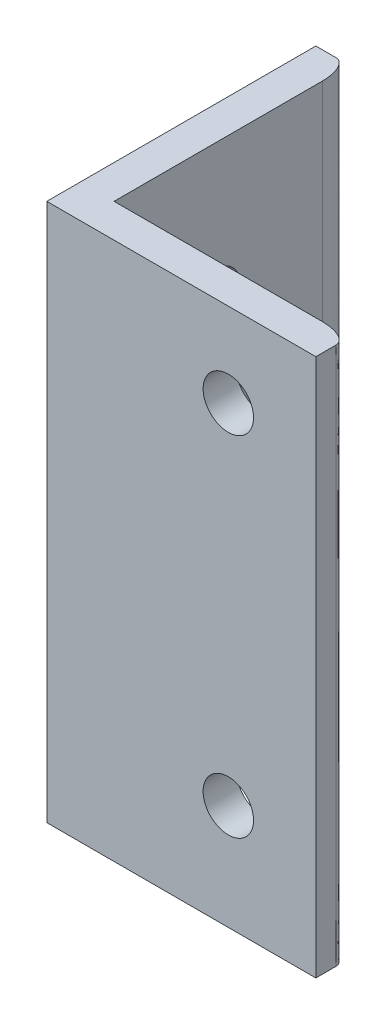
ISO-10303-21;
HEADER;
FILE_DESCRIPTION(('STEP AP214'),'2;1');
FILE_NAME('part.step','',(''),(''),'','','');
FILE_SCHEMA(('AUTOMOTIVE_DESIGN { 1 0 10303 214 1 1 1 1 }'));
ENDSEC;
DATA;
#1=APPLICATION_CONTEXT('core data for automotive mechanical design processes');
#2=APPLICATION_PROTOCOL_DEFINITION('international standard','automotive_design',2000,#1);
#3=PRODUCT_CONTEXT('',#1,'mechanical');
#4=PRODUCT('Part','Part','',(#3));
#5=PRODUCT_RELATED_PRODUCT_CATEGORY('part','',(#4));
#6=PRODUCT_DEFINITION_FORMATION('','',#4);
#7=PRODUCT_DEFINITION_CONTEXT('part definition',#1,'design');
#8=PRODUCT_DEFINITION('design','',#6,#7);
#9=PRODUCT_DEFINITION_SHAPE('','',#8);
#10=(LENGTH_UNIT() NAMED_UNIT(*) SI_UNIT(.MILLI.,.METRE.));
#11=(NAMED_UNIT(*) PLANE_ANGLE_UNIT() SI_UNIT($,.RADIAN.));
#12=(NAMED_UNIT(*) SI_UNIT($,.STERADIAN.) SOLID_ANGLE_UNIT());
#13=UNCERTAINTY_MEASURE_WITH_UNIT(LENGTH_MEASURE(1.E-05),#10,'distance_accuracy_value','');
#14=(GEOMETRIC_REPRESENTATION_CONTEXT(3) GLOBAL_UNCERTAINTY_ASSIGNED_CONTEXT((#13)) GLOBAL_UNIT_ASSIGNED_CONTEXT((#10,
#11,#12)) REPRESENTATION_CONTEXT('',''));
#15=CARTESIAN_POINT('',(0.,0.,0.));
#16=DIRECTION('',(0.,0.,1.));
#17=DIRECTION('',(1.,0.,0.));
#18=AXIS2_PLACEMENT_3D('',#15,#16,#17);
#19=CARTESIAN_POINT('',(0.,50.8,0.));
#20=DIRECTION('',(0.,0.,1.));
#21=DIRECTION('',(1.,0.,0.));
#22=AXIS2_PLACEMENT_3D('',#19,#20,#21);
#23=PLANE('',#22);
#24=DIRECTION('',(-1.,0.,0.));
#25=VECTOR('',#24,1.);
#26=CARTESIAN_POINT('',(0.,50.8,0.));
#27=LINE('',#26,#25);
#28=CARTESIAN_POINT('',(1.905,50.8,0.));
#29=VERTEX_POINT('',#28);
#30=CARTESIAN_POINT('',(0.,50.8,0.));
#31=VERTEX_POINT('',#30);
#32=EDGE_CURVE('E113',#29,#31,#27,.T.);
#33=ORIENTED_EDGE('',*,*,#32,.F.);
#34=CARTESIAN_POINT('',(1.905,-2.53999999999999,0.));
#35=CARTESIAN_POINT('',(1.905,16.0866666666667,0.));
#36=CARTESIAN_POINT('',(1.905,34.7133333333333,0.));
#37=CARTESIAN_POINT('',(1.905,53.34,0.));
#38=(BOUNDED_CURVE() B_SPLINE_CURVE(3,(#34,#35,#36,#37),.UNSPECIFIED.,.F.,
.F.) B_SPLINE_CURVE_WITH_KNOTS((4,4),(-0.00254,0.05334),
.UNSPECIFIED.) CURVE() GEOMETRIC_REPRESENTATION_ITEM() RATIONAL_B_SPLINE_CURVE((1.,1.,1.,1.)) REPRESENTATION_ITEM(''));
#39=CARTESIAN_POINT('',(1.905,0.,0.));
#40=VERTEX_POINT('',#39);
#41=EDGE_CURVE('E140',#29,#40,#38,.F.);
#42=ORIENTED_EDGE('',*,*,#41,.T.);
#43=DIRECTION('',(-1.,0.,0.));
#44=VECTOR('',#43,1.);
#45=CARTESIAN_POINT('',(0.,0.,0.));
#46=LINE('',#45,#44);
#47=CARTESIAN_POINT('',(0.,0.,0.));
#48=VERTEX_POINT('',#47);
#49=EDGE_CURVE('E138',#40,#48,#46,.T.);
#50=ORIENTED_EDGE('',*,*,#49,.T.);
#51=DIRECTION('',(0.,-1.,0.));
#52=VECTOR('',#51,1.);
#53=CARTESIAN_POINT('',(0.,50.8,0.));
#54=LINE('',#53,#52);
#55=EDGE_CURVE('E131',#31,#48,#54,.T.);
#56=ORIENTED_EDGE('',*,*,#55,.F.);
#57=EDGE_LOOP('',(#33,#42,#50,#56));
#58=FACE_BOUND('',#57,.T.);
#59=ADVANCED_FACE('F41',(#58),#23,.F.);
#60=CARTESIAN_POINT('',(0.,50.8,0.));
#61=DIRECTION('',(1.,0.,0.));
#62=DIRECTION('',(0.,0.,-1.));
#63=AXIS2_PLACEMENT_3D('',#60,#61,#62);
#64=PLANE('',#63);
#65=CARTESIAN_POINT('',(0.,12.7,12.7));
#66=DIRECTION('',(1.,0.,0.));
#67=DIRECTION('',(0.,0.,-1.));
#68=AXIS2_PLACEMENT_3D('',#65,#66,#67);
#69=CIRCLE('',#68,2.38125);
#70=CARTESIAN_POINT('',(0.,12.7,10.31875));
#71=VERTEX_POINT('',#70);
#72=EDGE_CURVE('E336',#71,#71,#69,.T.);
#73=ORIENTED_EDGE('',*,*,#72,.T.);
#74=EDGE_LOOP('',(#73));
#75=FACE_BOUND('',#74,.T.);
#76=CARTESIAN_POINT('',(0.,38.1,12.7));
#77=DIRECTION('',(1.,0.,0.));
#78=DIRECTION('',(0.,0.,-1.));
#79=AXIS2_PLACEMENT_3D('',#76,#77,#78);
#80=CIRCLE('',#79,2.38125);
#81=CARTESIAN_POINT('',(0.,38.1,10.31875));
#82=VERTEX_POINT('',#81);
#83=EDGE_CURVE('E330',#82,#82,#80,.T.);
#84=ORIENTED_EDGE('',*,*,#83,.T.);
#85=EDGE_LOOP('',(#84));
#86=FACE_BOUND('',#85,.T.);
#87=DIRECTION('',(0.,0.,1.));
#88=VECTOR('',#87,1.);
#89=CARTESIAN_POINT('',(0.,0.,0.));
#90=LINE('',#89,#88);
#91=CARTESIAN_POINT('',(0.,0.,25.4));
#92=VERTEX_POINT('',#91);
#93=EDGE_CURVE('E148',#48,#92,#90,.T.);
#94=ORIENTED_EDGE('',*,*,#93,.T.);
#95=DIRECTION('',(0.,-1.,0.));
#96=VECTOR('',#95,1.);
#97=CARTESIAN_POINT('',(0.,50.8,25.4));
#98=LINE('',#97,#96);
#99=CARTESIAN_POINT('',(0.,50.8,25.4));
#100=VERTEX_POINT('',#99);
#101=EDGE_CURVE('E133',#100,#92,#98,.T.);
#102=ORIENTED_EDGE('',*,*,#101,.F.);
#103=DIRECTION('',(0.,0.,1.));
#104=VECTOR('',#103,1.);
#105=CARTESIAN_POINT('',(0.,50.8,0.));
#106=LINE('',#105,#104);
#107=EDGE_CURVE('E116',#31,#100,#106,.T.);
#108=ORIENTED_EDGE('',*,*,#107,.F.);
#109=ORIENTED_EDGE('',*,*,#55,.T.);
#110=EDGE_LOOP('',(#94,#102,#108,#109));
#111=FACE_BOUND('',#110,.T.);
#112=ADVANCED_FACE('F130',(#75,#86,#111),#64,.F.);
#113=CARTESIAN_POINT('',(0.,50.8,25.4));
#114=DIRECTION('',(0.,0.,-1.));
#115=DIRECTION('',(-1.,0.,0.));
#116=AXIS2_PLACEMENT_3D('',#113,#114,#115);
#117=PLANE('',#116);
#118=CARTESIAN_POINT('',(17.13738,9.94664,25.4));
#119=DIRECTION('',(0.,0.,-1.));
#120=DIRECTION('',(-1.,0.,0.));
#121=AXIS2_PLACEMENT_3D('',#118,#119,#120);
#122=CIRCLE('',#121,2.38125);
#123=CARTESIAN_POINT('',(14.75613,9.94664,25.4));
#124=VERTEX_POINT('',#123);
#125=EDGE_CURVE('E324',#124,#124,#122,.T.);
#126=ORIENTED_EDGE('',*,*,#125,.T.);
#127=EDGE_LOOP('',(#126));
#128=FACE_BOUND('',#127,.T.);
#129=CARTESIAN_POINT('',(17.13738,42.8625,25.4));
#130=DIRECTION('',(0.,0.,-1.));
#131=DIRECTION('',(-1.,0.,0.));
#132=AXIS2_PLACEMENT_3D('',#129,#130,#131);
#133=CIRCLE('',#132,2.38125);
#134=CARTESIAN_POINT('',(14.75613,42.8625,25.4));
#135=VERTEX_POINT('',#134);
#136=EDGE_CURVE('E149',#135,#135,#133,.T.);
#137=ORIENTED_EDGE('',*,*,#136,.T.);
#138=EDGE_LOOP('',(#137));
#139=FACE_BOUND('',#138,.T.);
#140=DIRECTION('',(1.,0.,0.));
#141=VECTOR('',#140,1.);
#142=CARTESIAN_POINT('',(0.,0.,25.4));
#143=LINE('',#142,#141);
#144=CARTESIAN_POINT('',(25.4,0.,25.4));
#145=VERTEX_POINT('',#144);
#146=EDGE_CURVE('E158',#92,#145,#143,.T.);
#147=ORIENTED_EDGE('',*,*,#146,.T.);
#148=DIRECTION('',(0.,-1.,0.));
#149=VECTOR('',#148,1.);
#150=CARTESIAN_POINT('',(25.4,50.8,25.4));
#151=LINE('',#150,#149);
#152=CARTESIAN_POINT('',(25.4,50.8,25.4));
#153=VERTEX_POINT('',#152);
#154=EDGE_CURVE('E143',#153,#145,#151,.T.);
#155=ORIENTED_EDGE('',*,*,#154,.F.);
#156=DIRECTION('',(1.,0.,0.));
#157=VECTOR('',#156,1.);
#158=CARTESIAN_POINT('',(0.,50.8,25.4));
#159=LINE('',#158,#157);
#160=EDGE_CURVE('E135',#100,#153,#159,.T.);
#161=ORIENTED_EDGE('',*,*,#160,.F.);
#162=ORIENTED_EDGE('',*,*,#101,.T.);
#163=EDGE_LOOP('',(#147,#155,#161,#162));
#164=FACE_BOUND('',#163,.T.);
#165=ADVANCED_FACE('F364',(#128,#139,#164),#117,.F.);
#166=CARTESIAN_POINT('',(25.4,50.8,22.225));
#167=DIRECTION('',(-1.,0.,0.));
#168=DIRECTION('',(0.,0.,1.));
#169=AXIS2_PLACEMENT_3D('',#166,#167,#168);
#170=PLANE('',#169);
#171=DIRECTION('',(0.,0.,-1.));
#172=VECTOR('',#171,1.);
#173=CARTESIAN_POINT('',(25.4,0.,22.225));
#174=LINE('',#173,#172);
#175=CARTESIAN_POINT('',(25.4,0.,23.495));
#176=VERTEX_POINT('',#175);
#177=EDGE_CURVE('E160',#145,#176,#174,.T.);
#178=ORIENTED_EDGE('',*,*,#177,.T.);
#179=CARTESIAN_POINT('',(25.4,53.34,23.495));
#180=CARTESIAN_POINT('',(25.4,34.7133333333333,23.495));
#181=CARTESIAN_POINT('',(25.4,16.0866666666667,23.495));
#182=CARTESIAN_POINT('',(25.4,-2.53999999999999,23.495));
#183=(BOUNDED_CURVE() B_SPLINE_CURVE(3,(#179,#180,#181,#182),.UNSPECIFIED.,.F.,
.F.) B_SPLINE_CURVE_WITH_KNOTS((4,4),(-0.00254,0.05334),
.UNSPECIFIED.) CURVE() GEOMETRIC_REPRESENTATION_ITEM() RATIONAL_B_SPLINE_CURVE((1.,1.,1.,1.)) REPRESENTATION_ITEM(''));
#184=CARTESIAN_POINT('',(25.4,50.8,23.495));
#185=VERTEX_POINT('',#184);
#186=EDGE_CURVE('E55',#176,#185,#183,.F.);
#187=ORIENTED_EDGE('',*,*,#186,.T.);
#188=DIRECTION('',(0.,0.,-1.));
#189=VECTOR('',#188,1.);
#190=CARTESIAN_POINT('',(25.4,50.8,22.225));
#191=LINE('',#190,#189);
#192=EDGE_CURVE('E177',#153,#185,#191,.T.);
#193=ORIENTED_EDGE('',*,*,#192,.F.);
#194=ORIENTED_EDGE('',*,*,#154,.T.);
#195=EDGE_LOOP('',(#178,#187,#193,#194));
#196=FACE_BOUND('',#195,.T.);
#197=ADVANCED_FACE('F411',(#196),#170,.F.);
#198=CARTESIAN_POINT('',(3.175,50.8,22.225));
#199=DIRECTION('',(0.,0.,1.));
#200=DIRECTION('',(1.,0.,0.));
#201=AXIS2_PLACEMENT_3D('',#198,#199,#200);
#202=PLANE('',#201);
#203=CARTESIAN_POINT('',(17.13738,9.94664,22.225));
#204=DIRECTION('',(0.,0.,-1.));
#205=DIRECTION('',(-1.,0.,0.));
#206=AXIS2_PLACEMENT_3D('',#203,#204,#205);
#207=CIRCLE('',#206,2.38125);
#208=CARTESIAN_POINT('',(14.75613,9.94664,22.225));
#209=VERTEX_POINT('',#208);
#210=EDGE_CURVE('E327',#209,#209,#207,.T.);
#211=ORIENTED_EDGE('',*,*,#210,.F.);
#212=EDGE_LOOP('',(#211));
#213=FACE_BOUND('',#212,.T.);
#214=CARTESIAN_POINT('',(17.13738,42.8625,22.225));
#215=DIRECTION('',(0.,0.,-1.));
#216=DIRECTION('',(-1.,0.,0.));
#217=AXIS2_PLACEMENT_3D('',#214,#215,#216);
#218=CIRCLE('',#217,2.38125);
#219=CARTESIAN_POINT('',(14.75613,42.8625,22.225));
#220=VERTEX_POINT('',#219);
#221=EDGE_CURVE('E321',#220,#220,#218,.T.);
#222=ORIENTED_EDGE('',*,*,#221,.F.);
#223=EDGE_LOOP('',(#222));
#224=FACE_BOUND('',#223,.T.);
#225=DIRECTION('',(-1.,0.,0.));
#226=VECTOR('',#225,1.);
#227=CARTESIAN_POINT('',(3.175,50.8,22.225));
#228=LINE('',#227,#226);
#229=CARTESIAN_POINT('',(22.86,50.8,22.225));
#230=VERTEX_POINT('',#229);
#231=CARTESIAN_POINT('',(3.175,50.8,22.225));
#232=VERTEX_POINT('',#231);
#233=EDGE_CURVE('E209',#230,#232,#228,.T.);
#234=ORIENTED_EDGE('',*,*,#233,.F.);
#235=CARTESIAN_POINT('',(22.86,-2.53999999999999,22.225));
#236=CARTESIAN_POINT('',(22.86,16.0866666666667,22.225));
#237=CARTESIAN_POINT('',(22.86,34.7133333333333,22.225));
#238=CARTESIAN_POINT('',(22.86,53.34,22.225));
#239=(BOUNDED_CURVE() B_SPLINE_CURVE(3,(#235,#236,#237,#238),.UNSPECIFIED.,.F.,
.F.) B_SPLINE_CURVE_WITH_KNOTS((4,4),(-0.00254,0.05334),
.UNSPECIFIED.) CURVE() GEOMETRIC_REPRESENTATION_ITEM() RATIONAL_B_SPLINE_CURVE((1.,1.,1.,1.)) REPRESENTATION_ITEM(''));
#240=CARTESIAN_POINT('',(22.86,0.,22.225));
#241=VERTEX_POINT('',#240);
#242=EDGE_CURVE('E361',#230,#241,#239,.F.);
#243=ORIENTED_EDGE('',*,*,#242,.T.);
#244=DIRECTION('',(-1.,0.,0.));
#245=VECTOR('',#244,1.);
#246=CARTESIAN_POINT('',(3.175,0.,22.225));
#247=LINE('',#246,#245);
#248=CARTESIAN_POINT('',(3.175,0.,22.225));
#249=VERTEX_POINT('',#248);
#250=EDGE_CURVE('E167',#241,#249,#247,.T.);
#251=ORIENTED_EDGE('',*,*,#250,.T.);
#252=DIRECTION('',(0.,-1.,0.));
#253=VECTOR('',#252,1.);
#254=CARTESIAN_POINT('',(3.175,50.8,22.225));
#255=LINE('',#254,#253);
#256=EDGE_CURVE('E208',#232,#249,#255,.T.);
#257=ORIENTED_EDGE('',*,*,#256,.F.);
#258=EDGE_LOOP('',(#234,#243,#251,#257));
#259=FACE_BOUND('',#258,.T.);
#260=ADVANCED_FACE('F356',(#213,#224,#259),#202,.F.);
#261=CARTESIAN_POINT('',(3.175,50.8,0.));
#262=DIRECTION('',(-1.,0.,0.));
#263=DIRECTION('',(0.,0.,1.));
#264=AXIS2_PLACEMENT_3D('',#261,#262,#263);
#265=PLANE('',#264);
#266=CARTESIAN_POINT('',(3.175,12.7,12.7));
#267=DIRECTION('',(1.,0.,0.));
#268=DIRECTION('',(0.,0.,-1.));
#269=AXIS2_PLACEMENT_3D('',#266,#267,#268);
#270=CIRCLE('',#269,2.38125);
#271=CARTESIAN_POINT('',(3.175,12.7,10.31875));
#272=VERTEX_POINT('',#271);
#273=EDGE_CURVE('E339',#272,#272,#270,.T.);
#274=ORIENTED_EDGE('',*,*,#273,.F.);
#275=EDGE_LOOP('',(#274));
#276=FACE_BOUND('',#275,.T.);
#277=CARTESIAN_POINT('',(3.175,38.1,12.7));
#278=DIRECTION('',(1.,0.,0.));
#279=DIRECTION('',(0.,0.,-1.));
#280=AXIS2_PLACEMENT_3D('',#277,#278,#279);
#281=CIRCLE('',#280,2.38125);
#282=CARTESIAN_POINT('',(3.175,38.1,10.31875));
#283=VERTEX_POINT('',#282);
#284=EDGE_CURVE('E333',#283,#283,#281,.T.);
#285=ORIENTED_EDGE('',*,*,#284,.F.);
#286=EDGE_LOOP('',(#285));
#287=FACE_BOUND('',#286,.T.);
#288=DIRECTION('',(0.,0.,-1.));
#289=VECTOR('',#288,1.);
#290=CARTESIAN_POINT('',(3.175,0.,0.));
#291=LINE('',#290,#289);
#292=CARTESIAN_POINT('',(3.175,0.,2.54));
#293=VERTEX_POINT('',#292);
#294=EDGE_CURVE('E126',#249,#293,#291,.T.);
#295=ORIENTED_EDGE('',*,*,#294,.T.);
#296=CARTESIAN_POINT('',(3.175,53.34,2.54));
#297=CARTESIAN_POINT('',(3.175,34.7133333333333,2.54));
#298=CARTESIAN_POINT('',(3.175,16.0866666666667,2.54));
#299=CARTESIAN_POINT('',(3.175,-2.53999999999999,2.54));
#300=(BOUNDED_CURVE() B_SPLINE_CURVE(3,(#296,#297,#298,#299),.UNSPECIFIED.,.F.,
.F.) B_SPLINE_CURVE_WITH_KNOTS((4,4),(-0.00254,0.05334),
.UNSPECIFIED.) CURVE() GEOMETRIC_REPRESENTATION_ITEM() RATIONAL_B_SPLINE_CURVE((1.,1.,1.,1.)) REPRESENTATION_ITEM(''));
#301=CARTESIAN_POINT('',(3.175,50.8,2.54));
#302=VERTEX_POINT('',#301);
#303=EDGE_CURVE('E215',#293,#302,#300,.F.);
#304=ORIENTED_EDGE('',*,*,#303,.T.);
#305=DIRECTION('',(0.,0.,-1.));
#306=VECTOR('',#305,1.);
#307=CARTESIAN_POINT('',(3.175,50.8,0.));
#308=LINE('',#307,#306);
#309=EDGE_CURVE('E201',#232,#302,#308,.T.);
#310=ORIENTED_EDGE('',*,*,#309,.F.);
#311=ORIENTED_EDGE('',*,*,#256,.T.);
#312=EDGE_LOOP('',(#295,#304,#310,#311));
#313=FACE_BOUND('',#312,.T.);
#314=ADVANCED_FACE('F192',(#276,#287,#313),#265,.F.);
#315=CARTESIAN_POINT('',(0.,50.8,0.));
#316=DIRECTION('',(0.,-1.,0.));
#317=DIRECTION('',(0.,0.,-1.));
#318=AXIS2_PLACEMENT_3D('',#315,#316,#317);
#319=PLANE('',#318);
#320=ORIENTED_EDGE('',*,*,#192,.T.);
#321=CARTESIAN_POINT('',(22.86,50.8,22.225));
#322=CARTESIAN_POINT('',(25.4,50.8,22.225));
#323=CARTESIAN_POINT('',(25.4,50.8,23.495));
#324=(BOUNDED_CURVE() B_SPLINE_CURVE(2,(#321,#322,#323),.UNSPECIFIED.,.F.,
.F.) B_SPLINE_CURVE_WITH_KNOTS((3,3),(0.,1.),
.UNSPECIFIED.) CURVE() GEOMETRIC_REPRESENTATION_ITEM() RATIONAL_B_SPLINE_CURVE((1.,
0.707106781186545,1.)) REPRESENTATION_ITEM(''));
#325=EDGE_CURVE('E12',#185,#230,#324,.F.);
#326=ORIENTED_EDGE('',*,*,#325,.T.);
#327=ORIENTED_EDGE('',*,*,#233,.T.);
#328=ORIENTED_EDGE('',*,*,#309,.T.);
#329=CARTESIAN_POINT('',(1.905,50.8,0.));
#330=CARTESIAN_POINT('',(3.175,50.8,0.));
#331=CARTESIAN_POINT('',(3.175,50.8,2.54));
#332=(BOUNDED_CURVE() B_SPLINE_CURVE(2,(#329,#330,#331),.UNSPECIFIED.,.F.,
.F.) B_SPLINE_CURVE_WITH_KNOTS((3,3),(0.,1.),
.UNSPECIFIED.) CURVE() GEOMETRIC_REPRESENTATION_ITEM() RATIONAL_B_SPLINE_CURVE((1.,
0.707106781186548,1.)) REPRESENTATION_ITEM(''));
#333=EDGE_CURVE('E120',#302,#29,#332,.F.);
#334=ORIENTED_EDGE('',*,*,#333,.T.);
#335=ORIENTED_EDGE('',*,*,#32,.T.);
#336=ORIENTED_EDGE('',*,*,#107,.T.);
#337=ORIENTED_EDGE('',*,*,#160,.T.);
#338=EDGE_LOOP('',(#320,#326,#327,#328,#334,#335,#336,#337));
#339=FACE_BOUND('',#338,.T.);
#340=ADVANCED_FACE('F115',(#339),#319,.F.);
#341=CARTESIAN_POINT('',(0.,0.,0.));
#342=DIRECTION('',(0.,-1.,0.));
#343=DIRECTION('',(0.,0.,-1.));
#344=AXIS2_PLACEMENT_3D('',#341,#342,#343);
#345=PLANE('',#344);
#346=ORIENTED_EDGE('',*,*,#250,.F.);
#347=CARTESIAN_POINT('',(25.4,0.,23.495));
#348=CARTESIAN_POINT('',(25.4,0.,22.225));
#349=CARTESIAN_POINT('',(22.86,0.,22.225));
#350=(BOUNDED_CURVE() B_SPLINE_CURVE(2,(#347,#348,#349),.UNSPECIFIED.,.F.,
.F.) B_SPLINE_CURVE_WITH_KNOTS((3,3),(0.,1.),
.UNSPECIFIED.) CURVE() GEOMETRIC_REPRESENTATION_ITEM() RATIONAL_B_SPLINE_CURVE((1.,
0.707106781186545,1.)) REPRESENTATION_ITEM(''));
#351=EDGE_CURVE('E70',#241,#176,#350,.F.);
#352=ORIENTED_EDGE('',*,*,#351,.T.);
#353=ORIENTED_EDGE('',*,*,#177,.F.);
#354=ORIENTED_EDGE('',*,*,#146,.F.);
#355=ORIENTED_EDGE('',*,*,#93,.F.);
#356=ORIENTED_EDGE('',*,*,#49,.F.);
#357=CARTESIAN_POINT('',(3.175,0.,2.54));
#358=CARTESIAN_POINT('',(3.175,0.,0.));
#359=CARTESIAN_POINT('',(1.905,0.,0.));
#360=(BOUNDED_CURVE() B_SPLINE_CURVE(2,(#357,#358,#359),.UNSPECIFIED.,.F.,
.F.) B_SPLINE_CURVE_WITH_KNOTS((3,3),(0.,1.),
.UNSPECIFIED.) CURVE() GEOMETRIC_REPRESENTATION_ITEM() RATIONAL_B_SPLINE_CURVE((1.,
0.707106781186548,1.)) REPRESENTATION_ITEM(''));
#361=EDGE_CURVE('E142',#40,#293,#360,.F.);
#362=ORIENTED_EDGE('',*,*,#361,.T.);
#363=ORIENTED_EDGE('',*,*,#294,.F.);
#364=EDGE_LOOP('',(#346,#352,#353,#354,#355,#356,#362,#363));
#365=FACE_BOUND('',#364,.T.);
#366=ADVANCED_FACE('F179',(#365),#345,.T.);
#367=CARTESIAN_POINT('',(1.905,53.34,0.));
#368=CARTESIAN_POINT('',(1.905,34.7133333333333,0.));
#369=CARTESIAN_POINT('',(1.905,16.0866666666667,0.));
#370=CARTESIAN_POINT('',(1.905,-2.53999999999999,0.));
#371=CARTESIAN_POINT('',(3.175,53.34,0.));
#372=CARTESIAN_POINT('',(3.175,34.7133333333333,0.));
#373=CARTESIAN_POINT('',(3.175,16.0866666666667,0.));
#374=CARTESIAN_POINT('',(3.175,-2.53999999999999,0.));
#375=CARTESIAN_POINT('',(3.175,53.34,2.54));
#376=CARTESIAN_POINT('',(3.175,34.7133333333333,2.54));
#377=CARTESIAN_POINT('',(3.175,16.0866666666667,2.54));
#378=CARTESIAN_POINT('',(3.175,-2.53999999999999,2.54));
#379=(BOUNDED_SURFACE() B_SPLINE_SURFACE(2,3,((#367,#368,#369,#370),(#371,#372,#373,#374),(#375,
#376,#377,#378)),.UNSPECIFIED.,.F.,.F.,.F.) B_SPLINE_SURFACE_WITH_KNOTS((3,3),(4,4),(0.,1.),
(-0.00254,0.05334),
.UNSPECIFIED.) GEOMETRIC_REPRESENTATION_ITEM() RATIONAL_B_SPLINE_SURFACE(((1.,1.,1.,1.),
(0.707106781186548,0.707106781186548,0.707106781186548,0.707106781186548),(1.,1.,1.,1.))) REPRESENTATION_ITEM('') SURFACE());
#380=ORIENTED_EDGE('',*,*,#333,.F.);
#381=ORIENTED_EDGE('',*,*,#303,.F.);
#382=ORIENTED_EDGE('',*,*,#361,.F.);
#383=ORIENTED_EDGE('',*,*,#41,.F.);
#384=EDGE_LOOP('',(#380,#381,#382,#383));
#385=FACE_BOUND('',#384,.T.);
#386=ADVANCED_FACE('F189',(#385),#379,.T.);
#387=CARTESIAN_POINT('',(22.86,53.34,22.225));
#388=CARTESIAN_POINT('',(22.86,34.7133333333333,22.225));
#389=CARTESIAN_POINT('',(22.86,16.0866666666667,22.225));
#390=CARTESIAN_POINT('',(22.86,-2.53999999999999,22.225));
#391=CARTESIAN_POINT('',(25.4,53.34,22.225));
#392=CARTESIAN_POINT('',(25.4,34.7133333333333,22.225));
#393=CARTESIAN_POINT('',(25.4,16.0866666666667,22.225));
#394=CARTESIAN_POINT('',(25.4,-2.53999999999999,22.225));
#395=CARTESIAN_POINT('',(25.4,53.34,23.495));
#396=CARTESIAN_POINT('',(25.4,34.7133333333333,23.495));
#397=CARTESIAN_POINT('',(25.4,16.0866666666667,23.495));
#398=CARTESIAN_POINT('',(25.4,-2.53999999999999,23.495));
#399=(BOUNDED_SURFACE() B_SPLINE_SURFACE(2,3,((#387,#388,#389,#390),(#391,#392,#393,#394),(#395,
#396,#397,#398)),.UNSPECIFIED.,.F.,.F.,.F.) B_SPLINE_SURFACE_WITH_KNOTS((3,3),(4,4),(0.,1.),
(-0.00254,0.05334),
.UNSPECIFIED.) GEOMETRIC_REPRESENTATION_ITEM() RATIONAL_B_SPLINE_SURFACE(((1.,1.,1.,1.),
(0.707106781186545,0.707106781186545,0.707106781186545,0.707106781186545),(1.,1.,1.,1.))) REPRESENTATION_ITEM('') SURFACE());
#400=ORIENTED_EDGE('',*,*,#325,.F.);
#401=ORIENTED_EDGE('',*,*,#186,.F.);
#402=ORIENTED_EDGE('',*,*,#351,.F.);
#403=ORIENTED_EDGE('',*,*,#242,.F.);
#404=EDGE_LOOP('',(#400,#401,#402,#403));
#405=FACE_BOUND('',#404,.T.);
#406=ADVANCED_FACE('F44',(#405),#399,.T.);
#407=CARTESIAN_POINT('',(17.13738,42.8625,25.4));
#408=DIRECTION('',(0.,0.,-1.));
#409=DIRECTION('',(-1.,0.,0.));
#410=AXIS2_PLACEMENT_3D('',#407,#408,#409);
#411=CYLINDRICAL_SURFACE('',#410,2.38125);
#412=ORIENTED_EDGE('',*,*,#136,.F.);
#413=EDGE_LOOP('',(#412));
#414=FACE_BOUND('',#413,.T.);
#415=ORIENTED_EDGE('',*,*,#221,.T.);
#416=EDGE_LOOP('',(#415));
#417=FACE_BOUND('',#416,.T.);
#418=ADVANCED_FACE('F468',(#414,#417),#411,.F.);
#419=CARTESIAN_POINT('',(17.13738,9.94664,25.4));
#420=DIRECTION('',(0.,0.,-1.));
#421=DIRECTION('',(-1.,0.,0.));
#422=AXIS2_PLACEMENT_3D('',#419,#420,#421);
#423=CYLINDRICAL_SURFACE('',#422,2.38125);
#424=ORIENTED_EDGE('',*,*,#125,.F.);
#425=EDGE_LOOP('',(#424));
#426=FACE_BOUND('',#425,.T.);
#427=ORIENTED_EDGE('',*,*,#210,.T.);
#428=EDGE_LOOP('',(#427));
#429=FACE_BOUND('',#428,.T.);
#430=ADVANCED_FACE('F487',(#426,#429),#423,.F.);
#431=CARTESIAN_POINT('',(0.,38.1,12.7));
#432=DIRECTION('',(1.,0.,0.));
#433=DIRECTION('',(0.,0.,-1.));
#434=AXIS2_PLACEMENT_3D('',#431,#432,#433);
#435=CYLINDRICAL_SURFACE('',#434,2.38125);
#436=ORIENTED_EDGE('',*,*,#83,.F.);
#437=EDGE_LOOP('',(#436));
#438=FACE_BOUND('',#437,.T.);
#439=ORIENTED_EDGE('',*,*,#284,.T.);
#440=EDGE_LOOP('',(#439));
#441=FACE_BOUND('',#440,.T.);
#442=ADVANCED_FACE('F350',(#438,#441),#435,.F.);
#443=CARTESIAN_POINT('',(0.,12.7,12.7));
#444=DIRECTION('',(1.,0.,0.));
#445=DIRECTION('',(0.,0.,-1.));
#446=AXIS2_PLACEMENT_3D('',#443,#444,#445);
#447=CYLINDRICAL_SURFACE('',#446,2.38125);
#448=ORIENTED_EDGE('',*,*,#72,.F.);
#449=EDGE_LOOP('',(#448));
#450=FACE_BOUND('',#449,.T.);
#451=ORIENTED_EDGE('',*,*,#273,.T.);
#452=EDGE_LOOP('',(#451));
#453=FACE_BOUND('',#452,.T.);
#454=ADVANCED_FACE('F347',(#450,#453),#447,.F.);
#455=CLOSED_SHELL('',(#59,#112,#165,#197,#260,#314,#340,#366,#386,#406,#418,#430,#442,#454));
#456=MANIFOLD_SOLID_BREP('B2',#455);
#457=ADVANCED_BREP_SHAPE_REPRESENTATION('',(#18,#456),#14);
#458=SHAPE_DEFINITION_REPRESENTATION(#9,#457);
ENDSEC;
END-ISO-10303-21;
